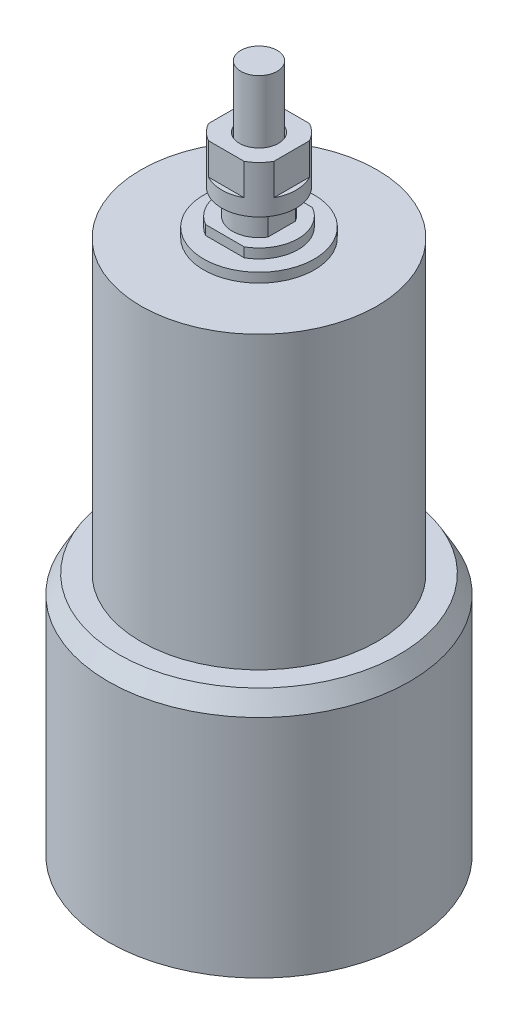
ISO-10303-21;
HEADER;
FILE_DESCRIPTION(('STEP AP214'),'2;1');
FILE_NAME('part.step','',(''),(''),'','','');
FILE_SCHEMA(('AUTOMOTIVE_DESIGN { 1 0 10303 214 1 1 1 1 }'));
ENDSEC;
DATA;
#1=APPLICATION_CONTEXT('core data for automotive mechanical design processes');
#2=APPLICATION_PROTOCOL_DEFINITION('international standard','automotive_design',2000,#1);
#3=PRODUCT_CONTEXT('',#1,'mechanical');
#4=PRODUCT('Part','Part','',(#3));
#5=PRODUCT_RELATED_PRODUCT_CATEGORY('part','',(#4));
#6=PRODUCT_DEFINITION_FORMATION('','',#4);
#7=PRODUCT_DEFINITION_CONTEXT('part definition',#1,'design');
#8=PRODUCT_DEFINITION('design','',#6,#7);
#9=PRODUCT_DEFINITION_SHAPE('','',#8);
#10=(LENGTH_UNIT() NAMED_UNIT(*) SI_UNIT(.MILLI.,.METRE.));
#11=(NAMED_UNIT(*) PLANE_ANGLE_UNIT() SI_UNIT($,.RADIAN.));
#12=(NAMED_UNIT(*) SI_UNIT($,.STERADIAN.) SOLID_ANGLE_UNIT());
#13=UNCERTAINTY_MEASURE_WITH_UNIT(LENGTH_MEASURE(1.E-05),#10,'distance_accuracy_value','');
#14=(GEOMETRIC_REPRESENTATION_CONTEXT(3) GLOBAL_UNCERTAINTY_ASSIGNED_CONTEXT((#13)) GLOBAL_UNIT_ASSIGNED_CONTEXT((#10,
#11,#12)) REPRESENTATION_CONTEXT('',''));
#15=CARTESIAN_POINT('',(0.,0.,0.));
#16=DIRECTION('',(0.,0.,1.));
#17=DIRECTION('',(1.,0.,0.));
#18=AXIS2_PLACEMENT_3D('',#15,#16,#17);
#19=CARTESIAN_POINT('',(0.,117.1194,0.));
#20=DIRECTION('',(0.,1.,0.));
#21=DIRECTION('',(0.,0.,1.));
#22=AXIS2_PLACEMENT_3D('',#19,#20,#21);
#23=PLANE('',#22);
#24=CARTESIAN_POINT('',(0.,117.1194,0.));
#25=DIRECTION('',(0.,1.,0.));
#26=DIRECTION('',(0.,0.,1.));
#27=AXIS2_PLACEMENT_3D('',#24,#25,#26);
#28=CIRCLE('',#27,6.8199);
#29=CARTESIAN_POINT('',(0.,117.1194,6.8199));
#30=VERTEX_POINT('',#29);
#31=EDGE_CURVE('E250',#30,#30,#28,.F.);
#32=ORIENTED_EDGE('',*,*,#31,.F.);
#33=EDGE_LOOP('',(#32));
#34=FACE_BOUND('',#33,.T.);
#35=CARTESIAN_POINT('',(0.,117.1194,0.));
#36=DIRECTION('',(0.,1.,0.));
#37=DIRECTION('',(0.,0.,1.));
#38=AXIS2_PLACEMENT_3D('',#35,#36,#37);
#39=CIRCLE('',#38,6.35);
#40=CARTESIAN_POINT('',(0.,117.1194,-6.35));
#41=VERTEX_POINT('',#40);
#42=EDGE_CURVE('E375',#41,#41,#39,.T.);
#43=ORIENTED_EDGE('',*,*,#42,.F.);
#44=EDGE_LOOP('',(#43));
#45=FACE_BOUND('',#44,.T.);
#46=ADVANCED_FACE('F32',(#34,#45),#23,.T.);
#47=CARTESIAN_POINT('',(0.,133.6294,0.));
#48=DIRECTION('',(0.,1.,0.));
#49=DIRECTION('',(0.,0.,1.));
#50=AXIS2_PLACEMENT_3D('',#47,#48,#49);
#51=PLANE('',#50);
#52=CARTESIAN_POINT('',(0.,133.6294,0.));
#53=DIRECTION('',(0.,1.,0.));
#54=DIRECTION('',(0.,0.,1.));
#55=AXIS2_PLACEMENT_3D('',#52,#53,#54);
#56=CIRCLE('',#55,6.8199);
#57=CARTESIAN_POINT('',(0.,133.6294,6.8199));
#58=VERTEX_POINT('',#57);
#59=EDGE_CURVE('E389',#58,#58,#56,.T.);
#60=ORIENTED_EDGE('',*,*,#59,.F.);
#61=EDGE_LOOP('',(#60));
#62=FACE_BOUND('',#61,.T.);
#63=CARTESIAN_POINT('',(0.,133.6294,0.));
#64=DIRECTION('',(0.,1.,0.));
#65=DIRECTION('',(0.,0.,1.));
#66=AXIS2_PLACEMENT_3D('',#63,#64,#65);
#67=CIRCLE('',#66,13.0175);
#68=CARTESIAN_POINT('',(6.22979985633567,133.6294,11.43));
#69=VERTEX_POINT('',#68);
#70=CARTESIAN_POINT('',(11.43,133.6294,6.22979985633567));
#71=VERTEX_POINT('',#70);
#72=EDGE_CURVE('E172',#69,#71,#67,.T.);
#73=ORIENTED_EDGE('',*,*,#72,.T.);
#74=DIRECTION('',(0.,0.,-1.));
#75=VECTOR('',#74,1.);
#76=CARTESIAN_POINT('',(11.43,133.6294,-11.43));
#77=LINE('',#76,#75);
#78=CARTESIAN_POINT('',(11.43,133.6294,-6.22979985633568));
#79=VERTEX_POINT('',#78);
#80=EDGE_CURVE('E156',#71,#79,#77,.T.);
#81=ORIENTED_EDGE('',*,*,#80,.T.);
#82=CARTESIAN_POINT('',(6.22979985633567,133.6294,-11.43));
#83=VERTEX_POINT('',#82);
#84=EDGE_CURVE('E164',#79,#83,#67,.T.);
#85=ORIENTED_EDGE('',*,*,#84,.T.);
#86=DIRECTION('',(-1.,0.,0.));
#87=VECTOR('',#86,1.);
#88=CARTESIAN_POINT('',(11.43,133.6294,-11.43));
#89=LINE('',#88,#87);
#90=CARTESIAN_POINT('',(-6.22979985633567,133.6294,-11.43));
#91=VERTEX_POINT('',#90);
#92=EDGE_CURVE('E144',#83,#91,#89,.T.);
#93=ORIENTED_EDGE('',*,*,#92,.T.);
#94=CARTESIAN_POINT('',(-11.43,133.6294,-6.22979985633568));
#95=VERTEX_POINT('',#94);
#96=EDGE_CURVE('E173',#91,#95,#67,.T.);
#97=ORIENTED_EDGE('',*,*,#96,.T.);
#98=DIRECTION('',(0.,0.,1.));
#99=VECTOR('',#98,1.);
#100=CARTESIAN_POINT('',(-11.43,133.6294,-11.43));
#101=LINE('',#100,#99);
#102=CARTESIAN_POINT('',(-11.43,133.6294,6.22979985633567));
#103=VERTEX_POINT('',#102);
#104=EDGE_CURVE('E155',#95,#103,#101,.T.);
#105=ORIENTED_EDGE('',*,*,#104,.T.);
#106=CARTESIAN_POINT('',(-6.22979985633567,133.6294,11.43));
#107=VERTEX_POINT('',#106);
#108=EDGE_CURVE('E176',#103,#107,#67,.T.);
#109=ORIENTED_EDGE('',*,*,#108,.T.);
#110=DIRECTION('',(1.,0.,0.));
#111=VECTOR('',#110,1.);
#112=CARTESIAN_POINT('',(11.43,133.6294,11.43));
#113=LINE('',#112,#111);
#114=EDGE_CURVE('E381',#107,#69,#113,.T.);
#115=ORIENTED_EDGE('',*,*,#114,.T.);
#116=EDGE_LOOP('',(#73,#81,#85,#93,#97,#105,#109,#115));
#117=FACE_BOUND('',#116,.T.);
#118=ADVANCED_FACE('F171',(#62,#117),#51,.T.);
#119=CARTESIAN_POINT('',(0.,133.6294,0.));
#120=DIRECTION('',(0.,-1.,0.));
#121=DIRECTION('',(0.,0.,-1.));
#122=AXIS2_PLACEMENT_3D('',#119,#120,#121);
#123=CYLINDRICAL_SURFACE('',#122,13.0175);
#124=CARTESIAN_POINT('',(0.,117.1194,0.));
#125=DIRECTION('',(0.,1.,0.));
#126=DIRECTION('',(0.,0.,1.));
#127=AXIS2_PLACEMENT_3D('',#124,#125,#126);
#128=CIRCLE('',#127,13.0175);
#129=CARTESIAN_POINT('',(0.,117.1194,13.0175));
#130=VERTEX_POINT('',#129);
#131=EDGE_CURVE('E179',#130,#130,#128,.T.);
#132=ORIENTED_EDGE('',*,*,#131,.T.);
#133=EDGE_LOOP('',(#132));
#134=FACE_BOUND('',#133,.T.);
#135=DIRECTION('',(0.,-1.,0.));
#136=VECTOR('',#135,1.);
#137=CARTESIAN_POINT('',(11.43,133.6294,6.22979985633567));
#138=LINE('',#137,#136);
#139=CARTESIAN_POINT('',(11.43,122.6058,6.22979985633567));
#140=VERTEX_POINT('',#139);
#141=EDGE_CURVE('E267',#71,#140,#138,.T.);
#142=ORIENTED_EDGE('',*,*,#141,.F.);
#143=ORIENTED_EDGE('',*,*,#72,.F.);
#144=DIRECTION('',(0.,-1.,0.));
#145=VECTOR('',#144,1.);
#146=CARTESIAN_POINT('',(6.22979985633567,133.6294,11.43));
#147=LINE('',#146,#145);
#148=CARTESIAN_POINT('',(6.22979985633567,122.6058,11.43));
#149=VERTEX_POINT('',#148);
#150=EDGE_CURVE('E260',#149,#69,#147,.F.);
#151=ORIENTED_EDGE('',*,*,#150,.F.);
#152=CARTESIAN_POINT('',(0.,122.6058,0.));
#153=DIRECTION('',(0.,1.,0.));
#154=DIRECTION('',(0.,0.,1.));
#155=AXIS2_PLACEMENT_3D('',#152,#153,#154);
#156=CIRCLE('',#155,13.0175);
#157=CARTESIAN_POINT('',(-6.22979985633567,122.6058,11.43));
#158=VERTEX_POINT('',#157);
#159=EDGE_CURVE('E262',#158,#149,#156,.T.);
#160=ORIENTED_EDGE('',*,*,#159,.F.);
#161=DIRECTION('',(0.,-1.,0.));
#162=VECTOR('',#161,1.);
#163=CARTESIAN_POINT('',(-6.22979985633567,133.6294,11.43));
#164=LINE('',#163,#162);
#165=EDGE_CURVE('E263',#107,#158,#164,.T.);
#166=ORIENTED_EDGE('',*,*,#165,.F.);
#167=ORIENTED_EDGE('',*,*,#108,.F.);
#168=DIRECTION('',(0.,-1.,0.));
#169=VECTOR('',#168,1.);
#170=CARTESIAN_POINT('',(-11.43,133.6294,6.22979985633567));
#171=LINE('',#170,#169);
#172=CARTESIAN_POINT('',(-11.43,122.6058,6.22979985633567));
#173=VERTEX_POINT('',#172);
#174=EDGE_CURVE('E167',#173,#103,#171,.F.);
#175=ORIENTED_EDGE('',*,*,#174,.F.);
#176=CARTESIAN_POINT('',(-11.43,122.6058,-6.22979985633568));
#177=VERTEX_POINT('',#176);
#178=EDGE_CURVE('E255',#177,#173,#156,.T.);
#179=ORIENTED_EDGE('',*,*,#178,.F.);
#180=DIRECTION('',(0.,-1.,0.));
#181=VECTOR('',#180,1.);
#182=CARTESIAN_POINT('',(-11.43,133.6294,-6.22979985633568));
#183=LINE('',#182,#181);
#184=EDGE_CURVE('E258',#95,#177,#183,.T.);
#185=ORIENTED_EDGE('',*,*,#184,.F.);
#186=ORIENTED_EDGE('',*,*,#96,.F.);
#187=DIRECTION('',(0.,-1.,0.));
#188=VECTOR('',#187,1.);
#189=CARTESIAN_POINT('',(-6.22979985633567,133.6294,-11.43));
#190=LINE('',#189,#188);
#191=CARTESIAN_POINT('',(-6.22979985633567,122.6058,-11.43));
#192=VERTEX_POINT('',#191);
#193=EDGE_CURVE('E150',#192,#91,#190,.F.);
#194=ORIENTED_EDGE('',*,*,#193,.F.);
#195=CARTESIAN_POINT('',(6.22979985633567,122.6058,-11.43));
#196=VERTEX_POINT('',#195);
#197=EDGE_CURVE('E166',#196,#192,#156,.T.);
#198=ORIENTED_EDGE('',*,*,#197,.F.);
#199=DIRECTION('',(0.,-1.,0.));
#200=VECTOR('',#199,1.);
#201=CARTESIAN_POINT('',(6.22979985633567,133.6294,-11.43));
#202=LINE('',#201,#200);
#203=EDGE_CURVE('E147',#83,#196,#202,.T.);
#204=ORIENTED_EDGE('',*,*,#203,.F.);
#205=ORIENTED_EDGE('',*,*,#84,.F.);
#206=DIRECTION('',(0.,-1.,0.));
#207=VECTOR('',#206,1.);
#208=CARTESIAN_POINT('',(11.43,133.6294,-6.22979985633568));
#209=LINE('',#208,#207);
#210=CARTESIAN_POINT('',(11.43,122.6058,-6.22979985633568));
#211=VERTEX_POINT('',#210);
#212=EDGE_CURVE('E265',#211,#79,#209,.F.);
#213=ORIENTED_EDGE('',*,*,#212,.F.);
#214=EDGE_CURVE('E254',#140,#211,#156,.T.);
#215=ORIENTED_EDGE('',*,*,#214,.F.);
#216=EDGE_LOOP('',(#142,#143,#151,#160,#166,#167,#175,#179,#185,#186,#194,#198,#204,#205,#213,#215));
#217=FACE_BOUND('',#216,.T.);
#218=ADVANCED_FACE('F162',(#134,#217),#123,.T.);
#219=CARTESIAN_POINT('',(0.,108.2294,0.));
#220=DIRECTION('',(0.,1.,0.));
#221=DIRECTION('',(0.,0.,1.));
#222=AXIS2_PLACEMENT_3D('',#219,#220,#221);
#223=PLANE('',#222);
#224=CARTESIAN_POINT('',(0.,108.2294,0.));
#225=DIRECTION('',(0.,1.,0.));
#226=DIRECTION('',(0.,0.,1.));
#227=AXIS2_PLACEMENT_3D('',#224,#225,#226);
#228=CIRCLE('',#227,13.6906);
#229=CARTESIAN_POINT('',(6.74703561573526,108.2294,11.9126));
#230=VERTEX_POINT('',#229);
#231=CARTESIAN_POINT('',(6.74703561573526,108.2294,-11.9126));
#232=VERTEX_POINT('',#231);
#233=EDGE_CURVE('E222',#230,#232,#228,.T.);
#234=ORIENTED_EDGE('',*,*,#233,.T.);
#235=DIRECTION('',(-1.,0.,0.));
#236=VECTOR('',#235,1.);
#237=CARTESIAN_POINT('',(6.74703561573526,108.2294,-11.9126));
#238=LINE('',#237,#236);
#239=CARTESIAN_POINT('',(-6.74703561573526,108.2294,-11.9126));
#240=VERTEX_POINT('',#239);
#241=EDGE_CURVE('E225',#232,#240,#238,.T.);
#242=ORIENTED_EDGE('',*,*,#241,.T.);
#243=CARTESIAN_POINT('',(0.,108.2294,0.));
#244=DIRECTION('',(0.,1.,0.));
#245=DIRECTION('',(0.,0.,1.));
#246=AXIS2_PLACEMENT_3D('',#243,#244,#245);
#247=CIRCLE('',#246,13.6906);
#248=CARTESIAN_POINT('',(-6.74703561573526,108.2294,11.9126));
#249=VERTEX_POINT('',#248);
#250=EDGE_CURVE('E227',#240,#249,#247,.T.);
#251=ORIENTED_EDGE('',*,*,#250,.T.);
#252=DIRECTION('',(1.,0.,0.));
#253=VECTOR('',#252,1.);
#254=CARTESIAN_POINT('',(6.74703561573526,108.2294,11.9126));
#255=LINE('',#254,#253);
#256=EDGE_CURVE('E229',#249,#230,#255,.T.);
#257=ORIENTED_EDGE('',*,*,#256,.T.);
#258=EDGE_LOOP('',(#234,#242,#251,#257));
#259=FACE_BOUND('',#258,.T.);
#260=DIRECTION('',(0.,0.,1.));
#261=VECTOR('',#260,1.);
#262=CARTESIAN_POINT('',(-7.9375,108.2294,-4.79035851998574));
#263=LINE('',#262,#261);
#264=CARTESIAN_POINT('',(-7.9375,108.2294,-4.79035851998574));
#265=VERTEX_POINT('',#264);
#266=CARTESIAN_POINT('',(-7.9375,108.2294,4.79035851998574));
#267=VERTEX_POINT('',#266);
#268=EDGE_CURVE('E183',#265,#267,#263,.T.);
#269=ORIENTED_EDGE('',*,*,#268,.F.);
#270=CARTESIAN_POINT('',(0.,108.2294,0.));
#271=DIRECTION('',(0.,1.,0.));
#272=DIRECTION('',(0.,0.,1.));
#273=AXIS2_PLACEMENT_3D('',#270,#271,#272);
#274=CIRCLE('',#273,9.271);
#275=CARTESIAN_POINT('',(7.9375,108.2294,-4.79035851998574));
#276=VERTEX_POINT('',#275);
#277=EDGE_CURVE('E175',#276,#265,#274,.T.);
#278=ORIENTED_EDGE('',*,*,#277,.F.);
#279=DIRECTION('',(0.,0.,-1.));
#280=VECTOR('',#279,1.);
#281=CARTESIAN_POINT('',(7.9375,108.2294,-4.79035851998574));
#282=LINE('',#281,#280);
#283=CARTESIAN_POINT('',(7.9375,108.2294,4.79035851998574));
#284=VERTEX_POINT('',#283);
#285=EDGE_CURVE('E188',#284,#276,#282,.T.);
#286=ORIENTED_EDGE('',*,*,#285,.F.);
#287=CARTESIAN_POINT('',(0.,108.2294,0.));
#288=DIRECTION('',(0.,1.,0.));
#289=DIRECTION('',(0.,0.,1.));
#290=AXIS2_PLACEMENT_3D('',#287,#288,#289);
#291=CIRCLE('',#290,9.271);
#292=EDGE_CURVE('E185',#267,#284,#291,.T.);
#293=ORIENTED_EDGE('',*,*,#292,.F.);
#294=EDGE_LOOP('',(#269,#278,#286,#293));
#295=FACE_BOUND('',#294,.T.);
#296=ADVANCED_FACE('F329',(#259,#295),#223,.T.);
#297=CARTESIAN_POINT('',(0.,104.902,0.));
#298=DIRECTION('',(0.,1.,0.));
#299=DIRECTION('',(0.,0.,1.));
#300=AXIS2_PLACEMENT_3D('',#297,#298,#299);
#301=PLANE('',#300);
#302=CARTESIAN_POINT('',(0.,104.902,0.));
#303=DIRECTION('',(0.,1.,0.));
#304=DIRECTION('',(0.,0.,1.));
#305=AXIS2_PLACEMENT_3D('',#302,#303,#304);
#306=CIRCLE('',#305,19.3675);
#307=CARTESIAN_POINT('',(0.,104.902,-19.3675));
#308=VERTEX_POINT('',#307);
#309=EDGE_CURVE('E244',#308,#308,#306,.T.);
#310=ORIENTED_EDGE('',*,*,#309,.T.);
#311=EDGE_LOOP('',(#310));
#312=FACE_BOUND('',#311,.T.);
#313=DIRECTION('',(-1.,0.,0.));
#314=VECTOR('',#313,1.);
#315=CARTESIAN_POINT('',(6.74703561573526,104.902,-11.9126));
#316=LINE('',#315,#314);
#317=CARTESIAN_POINT('',(6.74703561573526,104.902,-11.9126));
#318=VERTEX_POINT('',#317);
#319=CARTESIAN_POINT('',(-6.74703561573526,104.902,-11.9126));
#320=VERTEX_POINT('',#319);
#321=EDGE_CURVE('E215',#318,#320,#316,.T.);
#322=ORIENTED_EDGE('',*,*,#321,.F.);
#323=CARTESIAN_POINT('',(0.,104.902,0.));
#324=DIRECTION('',(0.,1.,0.));
#325=DIRECTION('',(0.,0.,1.));
#326=AXIS2_PLACEMENT_3D('',#323,#324,#325);
#327=CIRCLE('',#326,13.6906);
#328=CARTESIAN_POINT('',(6.74703561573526,104.902,11.9126));
#329=VERTEX_POINT('',#328);
#330=EDGE_CURVE('E212',#329,#318,#327,.T.);
#331=ORIENTED_EDGE('',*,*,#330,.F.);
#332=DIRECTION('',(1.,0.,0.));
#333=VECTOR('',#332,1.);
#334=CARTESIAN_POINT('',(6.74703561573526,104.902,11.9126));
#335=LINE('',#334,#333);
#336=CARTESIAN_POINT('',(-6.74703561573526,104.902,11.9126));
#337=VERTEX_POINT('',#336);
#338=EDGE_CURVE('E220',#337,#329,#335,.T.);
#339=ORIENTED_EDGE('',*,*,#338,.F.);
#340=CARTESIAN_POINT('',(0.,104.902,0.));
#341=DIRECTION('',(0.,1.,0.));
#342=DIRECTION('',(0.,0.,1.));
#343=AXIS2_PLACEMENT_3D('',#340,#341,#342);
#344=CIRCLE('',#343,13.6906);
#345=EDGE_CURVE('E217',#320,#337,#344,.T.);
#346=ORIENTED_EDGE('',*,*,#345,.F.);
#347=EDGE_LOOP('',(#322,#331,#339,#346));
#348=FACE_BOUND('',#347,.T.);
#349=ADVANCED_FACE('F332',(#312,#348),#301,.T.);
#350=CARTESIAN_POINT('',(0.,101.6,0.));
#351=DIRECTION('',(0.,1.,0.));
#352=DIRECTION('',(0.,0.,1.));
#353=AXIS2_PLACEMENT_3D('',#350,#351,#352);
#354=PLANE('',#353);
#355=CARTESIAN_POINT('',(0.,101.6,0.));
#356=DIRECTION('',(0.,1.,0.));
#357=DIRECTION('',(0.,0.,1.));
#358=AXIS2_PLACEMENT_3D('',#355,#356,#357);
#359=CIRCLE('',#358,41.275);
#360=CARTESIAN_POINT('',(0.,101.6,41.275));
#361=VERTEX_POINT('',#360);
#362=EDGE_CURVE('E247',#361,#361,#359,.T.);
#363=ORIENTED_EDGE('',*,*,#362,.T.);
#364=EDGE_LOOP('',(#363));
#365=FACE_BOUND('',#364,.T.);
#366=CARTESIAN_POINT('',(0.,101.6,0.));
#367=DIRECTION('',(0.,1.,0.));
#368=DIRECTION('',(0.,0.,1.));
#369=AXIS2_PLACEMENT_3D('',#366,#367,#368);
#370=CIRCLE('',#369,19.3675);
#371=CARTESIAN_POINT('',(0.,101.6,-19.3675));
#372=VERTEX_POINT('',#371);
#373=EDGE_CURVE('E241',#372,#372,#370,.T.);
#374=ORIENTED_EDGE('',*,*,#373,.F.);
#375=EDGE_LOOP('',(#374));
#376=FACE_BOUND('',#375,.T.);
#377=ADVANCED_FACE('F352',(#365,#376),#354,.T.);
#378=CARTESIAN_POINT('',(0.,101.6,0.));
#379=DIRECTION('',(0.,-1.,0.));
#380=DIRECTION('',(0.,0.,-1.));
#381=AXIS2_PLACEMENT_3D('',#378,#379,#380);
#382=CYLINDRICAL_SURFACE('',#381,41.275);
#383=ORIENTED_EDGE('',*,*,#362,.F.);
#384=EDGE_LOOP('',(#383));
#385=FACE_BOUND('',#384,.T.);
#386=CARTESIAN_POINT('',(0.,0.,0.));
#387=DIRECTION('',(0.,-1.,0.));
#388=DIRECTION('',(0.,0.,-1.));
#389=AXIS2_PLACEMENT_3D('',#386,#387,#388);
#390=CIRCLE('',#389,41.275);
#391=CARTESIAN_POINT('',(0.,0.,-41.275));
#392=VERTEX_POINT('',#391);
#393=EDGE_CURVE('E369',#392,#392,#390,.T.);
#394=ORIENTED_EDGE('',*,*,#393,.F.);
#395=EDGE_LOOP('',(#394));
#396=FACE_BOUND('',#395,.T.);
#397=ADVANCED_FACE('F356',(#385,#396),#382,.T.);
#398=CARTESIAN_POINT('',(0.,104.902,0.));
#399=DIRECTION('',(0.,-1.,0.));
#400=DIRECTION('',(0.,0.,-1.));
#401=AXIS2_PLACEMENT_3D('',#398,#399,#400);
#402=CYLINDRICAL_SURFACE('',#401,19.3675);
#403=CARTESIAN_POINT('',(0.,104.902,-19.3675));
#404=CARTESIAN_POINT('',(0.,104.867604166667,-19.3675));
#405=CARTESIAN_POINT('',(0.,104.833208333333,-19.3675));
#406=CARTESIAN_POINT('',(0.,104.764416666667,-19.3675));
#407=CARTESIAN_POINT('',(0.,104.730020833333,-19.3675));
#408=CARTESIAN_POINT('',(0.,104.661229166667,-19.3675));
#409=CARTESIAN_POINT('',(0.,104.626833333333,-19.3675));
#410=CARTESIAN_POINT('',(0.,104.558041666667,-19.3675));
#411=CARTESIAN_POINT('',(0.,104.523645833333,-19.3675));
#412=CARTESIAN_POINT('',(0.,104.454854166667,-19.3675));
#413=CARTESIAN_POINT('',(0.,104.420458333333,-19.3675));
#414=CARTESIAN_POINT('',(0.,104.351666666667,-19.3675));
#415=CARTESIAN_POINT('',(0.,104.317270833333,-19.3675));
#416=CARTESIAN_POINT('',(0.,104.248479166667,-19.3675));
#417=CARTESIAN_POINT('',(0.,104.214083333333,-19.3675));
#418=CARTESIAN_POINT('',(0.,104.145291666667,-19.3675));
#419=CARTESIAN_POINT('',(0.,104.110895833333,-19.3675));
#420=CARTESIAN_POINT('',(0.,104.042104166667,-19.3675));
#421=CARTESIAN_POINT('',(0.,104.007708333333,-19.3675));
#422=CARTESIAN_POINT('',(0.,103.938916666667,-19.3675));
#423=CARTESIAN_POINT('',(0.,103.904520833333,-19.3675));
#424=CARTESIAN_POINT('',(0.,103.835729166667,-19.3675));
#425=CARTESIAN_POINT('',(0.,103.801333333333,-19.3675));
#426=CARTESIAN_POINT('',(0.,103.732541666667,-19.3675));
#427=CARTESIAN_POINT('',(0.,103.698145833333,-19.3675));
#428=CARTESIAN_POINT('',(0.,103.629354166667,-19.3675));
#429=CARTESIAN_POINT('',(0.,103.594958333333,-19.3675));
#430=CARTESIAN_POINT('',(0.,103.526166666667,-19.3675));
#431=CARTESIAN_POINT('',(0.,103.491770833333,-19.3675));
#432=CARTESIAN_POINT('',(0.,103.422979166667,-19.3675));
#433=CARTESIAN_POINT('',(0.,103.388583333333,-19.3675));
#434=CARTESIAN_POINT('',(0.,103.319791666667,-19.3675));
#435=CARTESIAN_POINT('',(0.,103.285395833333,-19.3675));
#436=CARTESIAN_POINT('',(0.,103.216604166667,-19.3675));
#437=CARTESIAN_POINT('',(0.,103.182208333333,-19.3675));
#438=CARTESIAN_POINT('',(0.,103.113416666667,-19.3675));
#439=CARTESIAN_POINT('',(0.,103.079020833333,-19.3675));
#440=CARTESIAN_POINT('',(0.,103.010229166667,-19.3675));
#441=CARTESIAN_POINT('',(0.,102.975833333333,-19.3675));
#442=CARTESIAN_POINT('',(0.,102.907041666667,-19.3675));
#443=CARTESIAN_POINT('',(0.,102.872645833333,-19.3675));
#444=CARTESIAN_POINT('',(0.,102.803854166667,-19.3675));
#445=CARTESIAN_POINT('',(0.,102.769458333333,-19.3675));
#446=CARTESIAN_POINT('',(0.,102.700666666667,-19.3675));
#447=CARTESIAN_POINT('',(0.,102.666270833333,-19.3675));
#448=CARTESIAN_POINT('',(0.,102.597479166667,-19.3675));
#449=CARTESIAN_POINT('',(0.,102.563083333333,-19.3675));
#450=CARTESIAN_POINT('',(0.,102.494291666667,-19.3675));
#451=CARTESIAN_POINT('',(0.,102.459895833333,-19.3675));
#452=CARTESIAN_POINT('',(0.,102.391104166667,-19.3675));
#453=CARTESIAN_POINT('',(0.,102.356708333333,-19.3675));
#454=CARTESIAN_POINT('',(0.,102.287916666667,-19.3675));
#455=CARTESIAN_POINT('',(0.,102.253520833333,-19.3675));
#456=CARTESIAN_POINT('',(0.,102.184729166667,-19.3675));
#457=CARTESIAN_POINT('',(0.,102.150333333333,-19.3675));
#458=CARTESIAN_POINT('',(0.,102.081541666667,-19.3675));
#459=CARTESIAN_POINT('',(0.,102.047145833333,-19.3675));
#460=CARTESIAN_POINT('',(0.,101.978354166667,-19.3675));
#461=CARTESIAN_POINT('',(0.,101.943958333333,-19.3675));
#462=CARTESIAN_POINT('',(0.,101.875166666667,-19.3675));
#463=CARTESIAN_POINT('',(0.,101.840770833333,-19.3675));
#464=CARTESIAN_POINT('',(0.,101.771979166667,-19.3675));
#465=CARTESIAN_POINT('',(0.,101.737583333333,-19.3675));
#466=CARTESIAN_POINT('',(0.,101.668791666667,-19.3675));
#467=CARTESIAN_POINT('',(0.,101.634395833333,-19.3675));
#468=CARTESIAN_POINT('',(0.,101.6,-19.3675));
#469=B_SPLINE_CURVE_WITH_KNOTS('',3,(#403,#404,#405,#406,#407,#408,#409,#410,#411,#412,#413,
#414,#415,#416,#417,#418,#419,#420,#421,#422,#423,#424,#425,#426,#427,#428,#429,#430,#431,#432,
#433,#434,#435,#436,#437,#438,#439,#440,#441,#442,#443,#444,#445,#446,#447,#448,#449,#450,#451,
#452,#453,#454,#455,#456,#457,#458,#459,#460,#461,#462,#463,#464,#465,#466,#467,#468),
.UNSPECIFIED.,.F.,.F.,(4,2,2,2,2,2,2,2,2,2,2,2,2,2,2,2,2,2,2,2,2,2,2,2,2,2,2,2,2,2,2,2,4),(0.,
0.103187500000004,0.206375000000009,0.309562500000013,0.412750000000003,0.515937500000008,
0.619125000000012,0.722312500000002,0.825500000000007,0.928687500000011,1.031875,
1.13506250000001,1.23825000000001,1.3414375,1.444625,1.54781250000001,1.65100000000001,
1.7541875,1.85737500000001,1.96056250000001,2.06375,2.16693750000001,2.27012500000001,2.3733125,
2.47650000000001,2.57968750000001,2.682875,2.78606250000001,2.88925000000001,2.9924375,3.095625,
3.19881250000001,3.30200000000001),.UNSPECIFIED.);
#470=EDGE_CURVE('BSEAM348',#308,#372,#469,.T.);
#471=ORIENTED_EDGE('',*,*,#309,.F.);
#472=ORIENTED_EDGE('',*,*,#373,.T.);
#473=ORIENTED_EDGE('',*,*,#470,.T.);
#474=ORIENTED_EDGE('',*,*,#470,.F.);
#475=EDGE_LOOP('',(#471,#473,#472,#474));
#476=FACE_BOUND('',#475,.T.);
#477=ADVANCED_FACE('F348',(#476),#402,.T.);
#478=CARTESIAN_POINT('',(0.,108.2294,0.));
#479=DIRECTION('',(0.,-1.,0.));
#480=DIRECTION('',(0.,0.,-1.));
#481=AXIS2_PLACEMENT_3D('',#478,#479,#480);
#482=CYLINDRICAL_SURFACE('',#481,13.6906);
#483=ORIENTED_EDGE('',*,*,#330,.T.);
#484=DIRECTION('',(0.,-1.,0.));
#485=VECTOR('',#484,1.);
#486=CARTESIAN_POINT('',(6.74703561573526,108.2294,-11.9126));
#487=LINE('',#486,#485);
#488=EDGE_CURVE('E239',#232,#318,#487,.T.);
#489=ORIENTED_EDGE('',*,*,#488,.F.);
#490=ORIENTED_EDGE('',*,*,#233,.F.);
#491=DIRECTION('',(0.,-1.,0.));
#492=VECTOR('',#491,1.);
#493=CARTESIAN_POINT('',(6.74703561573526,108.2294,11.9126));
#494=LINE('',#493,#492);
#495=EDGE_CURVE('E231',#230,#329,#494,.T.);
#496=ORIENTED_EDGE('',*,*,#495,.T.);
#497=EDGE_LOOP('',(#483,#489,#490,#496));
#498=FACE_BOUND('',#497,.T.);
#499=ADVANCED_FACE('F344',(#498),#482,.T.);
#500=CARTESIAN_POINT('',(6.74703561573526,108.2294,-11.9126));
#501=DIRECTION('',(0.,0.,1.));
#502=DIRECTION('',(1.,0.,0.));
#503=AXIS2_PLACEMENT_3D('',#500,#501,#502);
#504=PLANE('',#503);
#505=ORIENTED_EDGE('',*,*,#321,.T.);
#506=DIRECTION('',(0.,-1.,0.));
#507=VECTOR('',#506,1.);
#508=CARTESIAN_POINT('',(-6.74703561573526,108.2294,-11.9126));
#509=LINE('',#508,#507);
#510=EDGE_CURVE('E236',#240,#320,#509,.T.);
#511=ORIENTED_EDGE('',*,*,#510,.F.);
#512=ORIENTED_EDGE('',*,*,#241,.F.);
#513=ORIENTED_EDGE('',*,*,#488,.T.);
#514=EDGE_LOOP('',(#505,#511,#512,#513));
#515=FACE_BOUND('',#514,.T.);
#516=ADVANCED_FACE('F340',(#515),#504,.F.);
#517=CARTESIAN_POINT('',(0.,108.2294,0.));
#518=DIRECTION('',(0.,-1.,0.));
#519=DIRECTION('',(0.,0.,-1.));
#520=AXIS2_PLACEMENT_3D('',#517,#518,#519);
#521=CYLINDRICAL_SURFACE('',#520,13.6906);
#522=ORIENTED_EDGE('',*,*,#345,.T.);
#523=DIRECTION('',(0.,-1.,0.));
#524=VECTOR('',#523,1.);
#525=CARTESIAN_POINT('',(-6.74703561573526,108.2294,11.9126));
#526=LINE('',#525,#524);
#527=EDGE_CURVE('E234',#249,#337,#526,.T.);
#528=ORIENTED_EDGE('',*,*,#527,.F.);
#529=ORIENTED_EDGE('',*,*,#250,.F.);
#530=ORIENTED_EDGE('',*,*,#510,.T.);
#531=EDGE_LOOP('',(#522,#528,#529,#530));
#532=FACE_BOUND('',#531,.T.);
#533=ADVANCED_FACE('F336',(#532),#521,.T.);
#534=CARTESIAN_POINT('',(6.74703561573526,108.2294,11.9126));
#535=DIRECTION('',(0.,0.,-1.));
#536=DIRECTION('',(-1.,0.,0.));
#537=AXIS2_PLACEMENT_3D('',#534,#535,#536);
#538=PLANE('',#537);
#539=ORIENTED_EDGE('',*,*,#338,.T.);
#540=ORIENTED_EDGE('',*,*,#495,.F.);
#541=ORIENTED_EDGE('',*,*,#256,.F.);
#542=ORIENTED_EDGE('',*,*,#527,.T.);
#543=EDGE_LOOP('',(#539,#540,#541,#542));
#544=FACE_BOUND('',#543,.T.);
#545=ADVANCED_FACE('F327',(#544),#538,.F.);
#546=CARTESIAN_POINT('',(0.,117.1194,0.));
#547=DIRECTION('',(0.,-1.,0.));
#548=DIRECTION('',(0.,0.,-1.));
#549=AXIS2_PLACEMENT_3D('',#546,#547,#548);
#550=CYLINDRICAL_SURFACE('',#549,9.271);
#551=ORIENTED_EDGE('',*,*,#277,.T.);
#552=DIRECTION('',(0.,-1.,0.));
#553=VECTOR('',#552,1.);
#554=CARTESIAN_POINT('',(-7.9375,117.1194,-4.79035851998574));
#555=LINE('',#554,#553);
#556=CARTESIAN_POINT('',(-7.9375,117.1194,-4.79035851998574));
#557=VERTEX_POINT('',#556);
#558=EDGE_CURVE('E210',#557,#265,#555,.T.);
#559=ORIENTED_EDGE('',*,*,#558,.F.);
#560=CARTESIAN_POINT('',(0.,117.1194,0.));
#561=DIRECTION('',(0.,1.,0.));
#562=DIRECTION('',(0.,0.,1.));
#563=AXIS2_PLACEMENT_3D('',#560,#561,#562);
#564=CIRCLE('',#563,9.271);
#565=CARTESIAN_POINT('',(7.9375,117.1194,-4.79035851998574));
#566=VERTEX_POINT('',#565);
#567=EDGE_CURVE('E190',#566,#557,#564,.T.);
#568=ORIENTED_EDGE('',*,*,#567,.F.);
#569=DIRECTION('',(0.,-1.,0.));
#570=VECTOR('',#569,1.);
#571=CARTESIAN_POINT('',(7.9375,117.1194,-4.79035851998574));
#572=LINE('',#571,#570);
#573=EDGE_CURVE('E202',#566,#276,#572,.T.);
#574=ORIENTED_EDGE('',*,*,#573,.T.);
#575=EDGE_LOOP('',(#551,#559,#568,#574));
#576=FACE_BOUND('',#575,.T.);
#577=ADVANCED_FACE('F323',(#576),#550,.T.);
#578=CARTESIAN_POINT('',(-7.9375,117.1194,-4.79035851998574));
#579=DIRECTION('',(1.,0.,0.));
#580=DIRECTION('',(0.,0.,-1.));
#581=AXIS2_PLACEMENT_3D('',#578,#579,#580);
#582=PLANE('',#581);
#583=ORIENTED_EDGE('',*,*,#268,.T.);
#584=DIRECTION('',(0.,-1.,0.));
#585=VECTOR('',#584,1.);
#586=CARTESIAN_POINT('',(-7.9375,117.1194,4.79035851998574));
#587=LINE('',#586,#585);
#588=CARTESIAN_POINT('',(-7.9375,117.1194,4.79035851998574));
#589=VERTEX_POINT('',#588);
#590=EDGE_CURVE('E207',#589,#267,#587,.T.);
#591=ORIENTED_EDGE('',*,*,#590,.F.);
#592=DIRECTION('',(0.,0.,1.));
#593=VECTOR('',#592,1.);
#594=CARTESIAN_POINT('',(-7.9375,117.1194,-4.79035851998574));
#595=LINE('',#594,#593);
#596=EDGE_CURVE('E193',#557,#589,#595,.T.);
#597=ORIENTED_EDGE('',*,*,#596,.F.);
#598=ORIENTED_EDGE('',*,*,#558,.T.);
#599=EDGE_LOOP('',(#583,#591,#597,#598));
#600=FACE_BOUND('',#599,.T.);
#601=ADVANCED_FACE('F319',(#600),#582,.F.);
#602=CARTESIAN_POINT('',(0.,117.1194,0.));
#603=DIRECTION('',(0.,-1.,0.));
#604=DIRECTION('',(0.,0.,-1.));
#605=AXIS2_PLACEMENT_3D('',#602,#603,#604);
#606=CYLINDRICAL_SURFACE('',#605,9.271);
#607=ORIENTED_EDGE('',*,*,#292,.T.);
#608=DIRECTION('',(0.,-1.,0.));
#609=VECTOR('',#608,1.);
#610=CARTESIAN_POINT('',(7.9375,117.1194,4.79035851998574));
#611=LINE('',#610,#609);
#612=CARTESIAN_POINT('',(7.9375,117.1194,4.79035851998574));
#613=VERTEX_POINT('',#612);
#614=EDGE_CURVE('E205',#613,#284,#611,.T.);
#615=ORIENTED_EDGE('',*,*,#614,.F.);
#616=CARTESIAN_POINT('',(0.,117.1194,0.));
#617=DIRECTION('',(0.,1.,0.));
#618=DIRECTION('',(0.,0.,1.));
#619=AXIS2_PLACEMENT_3D('',#616,#617,#618);
#620=CIRCLE('',#619,9.271);
#621=EDGE_CURVE('E196',#589,#613,#620,.T.);
#622=ORIENTED_EDGE('',*,*,#621,.F.);
#623=ORIENTED_EDGE('',*,*,#590,.T.);
#624=EDGE_LOOP('',(#607,#615,#622,#623));
#625=FACE_BOUND('',#624,.T.);
#626=ADVANCED_FACE('F315',(#625),#606,.T.);
#627=CARTESIAN_POINT('',(7.9375,117.1194,-4.79035851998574));
#628=DIRECTION('',(-1.,0.,0.));
#629=DIRECTION('',(0.,0.,1.));
#630=AXIS2_PLACEMENT_3D('',#627,#628,#629);
#631=PLANE('',#630);
#632=ORIENTED_EDGE('',*,*,#285,.T.);
#633=ORIENTED_EDGE('',*,*,#573,.F.);
#634=DIRECTION('',(0.,0.,-1.));
#635=VECTOR('',#634,1.);
#636=CARTESIAN_POINT('',(7.9375,117.1194,-4.79035851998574));
#637=LINE('',#636,#635);
#638=EDGE_CURVE('E199',#613,#566,#637,.T.);
#639=ORIENTED_EDGE('',*,*,#638,.F.);
#640=ORIENTED_EDGE('',*,*,#614,.T.);
#641=EDGE_LOOP('',(#632,#633,#639,#640));
#642=FACE_BOUND('',#641,.T.);
#643=ADVANCED_FACE('F311',(#642),#631,.F.);
#644=CARTESIAN_POINT('',(0.,117.1194,0.));
#645=DIRECTION('',(0.,1.,0.));
#646=DIRECTION('',(0.,0.,1.));
#647=AXIS2_PLACEMENT_3D('',#644,#645,#646);
#648=PLANE('',#647);
#649=ORIENTED_EDGE('',*,*,#131,.F.);
#650=EDGE_LOOP('',(#649));
#651=FACE_BOUND('',#650,.T.);
#652=ORIENTED_EDGE('',*,*,#638,.T.);
#653=ORIENTED_EDGE('',*,*,#567,.T.);
#654=ORIENTED_EDGE('',*,*,#596,.T.);
#655=ORIENTED_EDGE('',*,*,#621,.T.);
#656=EDGE_LOOP('',(#652,#653,#654,#655));
#657=FACE_BOUND('',#656,.T.);
#658=ADVANCED_FACE('F314',(#651,#657),#648,.F.);
#659=CARTESIAN_POINT('',(0.,133.6294,0.));
#660=DIRECTION('',(0.,-1.,0.));
#661=DIRECTION('',(0.,0.,-1.));
#662=AXIS2_PLACEMENT_3D('',#659,#660,#661);
#663=CYLINDRICAL_SURFACE('',#662,6.8199);
#664=ORIENTED_EDGE('',*,*,#59,.T.);
#665=EDGE_LOOP('',(#664));
#666=FACE_BOUND('',#665,.T.);
#667=ORIENTED_EDGE('',*,*,#31,.T.);
#668=EDGE_LOOP('',(#667));
#669=FACE_BOUND('',#668,.T.);
#670=ADVANCED_FACE('F430',(#666,#669),#663,.F.);
#671=CARTESIAN_POINT('',(11.43,122.6058,-11.43));
#672=DIRECTION('',(0.,0.,-1.));
#673=DIRECTION('',(-1.,0.,0.));
#674=AXIS2_PLACEMENT_3D('',#671,#672,#673);
#675=PLANE('',#674);
#676=ORIENTED_EDGE('',*,*,#203,.T.);
#677=DIRECTION('',(-1.,0.,0.));
#678=VECTOR('',#677,1.);
#679=CARTESIAN_POINT('',(11.43,122.6058,-11.43));
#680=LINE('',#679,#678);
#681=EDGE_CURVE('E385',#196,#192,#680,.T.);
#682=ORIENTED_EDGE('',*,*,#681,.T.);
#683=ORIENTED_EDGE('',*,*,#193,.T.);
#684=ORIENTED_EDGE('',*,*,#92,.F.);
#685=EDGE_LOOP('',(#676,#682,#683,#684));
#686=FACE_BOUND('',#685,.T.);
#687=ADVANCED_FACE('F146',(#686),#675,.T.);
#688=CARTESIAN_POINT('',(0.,122.6058,0.));
#689=DIRECTION('',(0.,1.,0.));
#690=DIRECTION('',(0.,0.,1.));
#691=AXIS2_PLACEMENT_3D('',#688,#689,#690);
#692=PLANE('',#691);
#693=ORIENTED_EDGE('',*,*,#197,.T.);
#694=ORIENTED_EDGE('',*,*,#681,.F.);
#695=EDGE_LOOP('',(#693,#694));
#696=FACE_BOUND('',#695,.T.);
#697=ADVANCED_FACE('F413',(#696),#692,.T.);
#698=CARTESIAN_POINT('',(-11.43,122.6058,-11.43));
#699=DIRECTION('',(-1.,0.,0.));
#700=DIRECTION('',(0.,0.,1.));
#701=AXIS2_PLACEMENT_3D('',#698,#699,#700);
#702=PLANE('',#701);
#703=ORIENTED_EDGE('',*,*,#184,.T.);
#704=DIRECTION('',(0.,0.,1.));
#705=VECTOR('',#704,1.);
#706=CARTESIAN_POINT('',(-11.43,122.6058,-11.43));
#707=LINE('',#706,#705);
#708=EDGE_CURVE('E387',#177,#173,#707,.T.);
#709=ORIENTED_EDGE('',*,*,#708,.T.);
#710=ORIENTED_EDGE('',*,*,#174,.T.);
#711=ORIENTED_EDGE('',*,*,#104,.F.);
#712=EDGE_LOOP('',(#703,#709,#710,#711));
#713=FACE_BOUND('',#712,.T.);
#714=ADVANCED_FACE('F422',(#713),#702,.T.);
#715=ORIENTED_EDGE('',*,*,#178,.T.);
#716=ORIENTED_EDGE('',*,*,#708,.F.);
#717=EDGE_LOOP('',(#715,#716));
#718=FACE_BOUND('',#717,.T.);
#719=ADVANCED_FACE('F419',(#718),#692,.T.);
#720=CARTESIAN_POINT('',(11.43,122.6058,11.43));
#721=DIRECTION('',(0.,0.,1.));
#722=DIRECTION('',(1.,0.,0.));
#723=AXIS2_PLACEMENT_3D('',#720,#721,#722);
#724=PLANE('',#723);
#725=ORIENTED_EDGE('',*,*,#165,.T.);
#726=DIRECTION('',(1.,0.,0.));
#727=VECTOR('',#726,1.);
#728=CARTESIAN_POINT('',(11.43,122.6058,11.43));
#729=LINE('',#728,#727);
#730=EDGE_CURVE('E55',#158,#149,#729,.T.);
#731=ORIENTED_EDGE('',*,*,#730,.T.);
#732=ORIENTED_EDGE('',*,*,#150,.T.);
#733=ORIENTED_EDGE('',*,*,#114,.F.);
#734=EDGE_LOOP('',(#725,#731,#732,#733));
#735=FACE_BOUND('',#734,.T.);
#736=ADVANCED_FACE('F404',(#735),#724,.T.);
#737=ORIENTED_EDGE('',*,*,#159,.T.);
#738=ORIENTED_EDGE('',*,*,#730,.F.);
#739=EDGE_LOOP('',(#737,#738));
#740=FACE_BOUND('',#739,.T.);
#741=ADVANCED_FACE('F406',(#740),#692,.T.);
#742=ORIENTED_EDGE('',*,*,#214,.T.);
#743=DIRECTION('',(0.,0.,-1.));
#744=VECTOR('',#743,1.);
#745=CARTESIAN_POINT('',(11.43,122.6058,-11.43));
#746=LINE('',#745,#744);
#747=EDGE_CURVE('E47',#140,#211,#746,.T.);
#748=ORIENTED_EDGE('',*,*,#747,.F.);
#749=EDGE_LOOP('',(#742,#748));
#750=FACE_BOUND('',#749,.T.);
#751=ADVANCED_FACE('F410',(#750),#692,.T.);
#752=CARTESIAN_POINT('',(11.43,122.6058,-11.43));
#753=DIRECTION('',(1.,0.,0.));
#754=DIRECTION('',(0.,0.,-1.));
#755=AXIS2_PLACEMENT_3D('',#752,#753,#754);
#756=PLANE('',#755);
#757=ORIENTED_EDGE('',*,*,#141,.T.);
#758=ORIENTED_EDGE('',*,*,#747,.T.);
#759=ORIENTED_EDGE('',*,*,#212,.T.);
#760=ORIENTED_EDGE('',*,*,#80,.F.);
#761=EDGE_LOOP('',(#757,#758,#759,#760));
#762=FACE_BOUND('',#761,.T.);
#763=ADVANCED_FACE('F408',(#762),#756,.T.);
#764=CARTESIAN_POINT('',(0.,0.,0.));
#765=DIRECTION('',(0.,-1.,0.));
#766=DIRECTION('',(0.,0.,-1.));
#767=AXIS2_PLACEMENT_3D('',#764,#765,#766);
#768=PLANE('',#767);
#769=CARTESIAN_POINT('',(0.,0.,0.));
#770=DIRECTION('',(0.,-1.,0.));
#771=DIRECTION('',(0.,0.,-1.));
#772=AXIS2_PLACEMENT_3D('',#769,#770,#771);
#773=CIRCLE('',#772,49.0388257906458);
#774=CARTESIAN_POINT('',(0.,0.,-49.0388257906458));
#775=VERTEX_POINT('',#774);
#776=EDGE_CURVE('E11',#775,#775,#773,.F.);
#777=ORIENTED_EDGE('',*,*,#776,.T.);
#778=EDGE_LOOP('',(#777));
#779=FACE_BOUND('',#778,.T.);
#780=ORIENTED_EDGE('',*,*,#393,.T.);
#781=EDGE_LOOP('',(#780));
#782=FACE_BOUND('',#781,.T.);
#783=ADVANCED_FACE('F296',(#779,#782),#768,.F.);
#784=CARTESIAN_POINT('',(0.,-88.9,0.));
#785=DIRECTION('',(0.,1.,0.));
#786=DIRECTION('',(0.,0.,1.));
#787=AXIS2_PLACEMENT_3D('',#784,#785,#786);
#788=CYLINDRICAL_SURFACE('',#787,52.705);
#789=CARTESIAN_POINT('',(0.,-85.2338257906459,0.));
#790=DIRECTION('',(0.,-1.,0.));
#791=DIRECTION('',(0.,0.,-1.));
#792=AXIS2_PLACEMENT_3D('',#789,#790,#791);
#793=CIRCLE('',#792,52.705);
#794=CARTESIAN_POINT('',(0.,-85.2338257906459,-52.705));
#795=VERTEX_POINT('',#794);
#796=EDGE_CURVE('E40',#795,#795,#793,.F.);
#797=ORIENTED_EDGE('',*,*,#796,.T.);
#798=EDGE_LOOP('',(#797));
#799=FACE_BOUND('',#798,.T.);
#800=CARTESIAN_POINT('',(0.,-6.35000000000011,0.));
#801=DIRECTION('',(0.,-1.,0.));
#802=DIRECTION('',(0.,0.,-1.));
#803=AXIS2_PLACEMENT_3D('',#800,#801,#802);
#804=CIRCLE('',#803,52.705);
#805=CARTESIAN_POINT('',(0.,-6.35000000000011,-52.705));
#806=VERTEX_POINT('',#805);
#807=EDGE_CURVE('E272',#806,#806,#804,.T.);
#808=ORIENTED_EDGE('',*,*,#807,.T.);
#809=EDGE_LOOP('',(#808));
#810=FACE_BOUND('',#809,.T.);
#811=ADVANCED_FACE('F277',(#799,#810),#788,.T.);
#812=CARTESIAN_POINT('',(0.,-88.9,0.));
#813=DIRECTION('',(0.,-1.,0.));
#814=DIRECTION('',(0.,0.,-1.));
#815=AXIS2_PLACEMENT_3D('',#812,#813,#814);
#816=PLANE('',#815);
#817=CARTESIAN_POINT('',(0.,-88.9,0.));
#818=DIRECTION('',(0.,-1.,0.));
#819=DIRECTION('',(0.,0.,-1.));
#820=AXIS2_PLACEMENT_3D('',#817,#818,#819);
#821=CIRCLE('',#820,46.355);
#822=CARTESIAN_POINT('',(0.,-88.9,-46.355));
#823=VERTEX_POINT('',#822);
#824=EDGE_CURVE('E269',#823,#823,#821,.T.);
#825=ORIENTED_EDGE('',*,*,#824,.T.);
#826=EDGE_LOOP('',(#825));
#827=FACE_BOUND('',#826,.T.);
#828=ADVANCED_FACE('F286',(#827),#816,.T.);
#829=CARTESIAN_POINT('',(0.,155.2194,0.));
#830=DIRECTION('',(0.,-1.,0.));
#831=DIRECTION('',(0.,0.,-1.));
#832=AXIS2_PLACEMENT_3D('',#829,#830,#831);
#833=CYLINDRICAL_SURFACE('',#832,6.35);
#834=CARTESIAN_POINT('',(0.,155.2194,0.));
#835=DIRECTION('',(0.,1.,0.));
#836=DIRECTION('',(0.,0.,1.));
#837=AXIS2_PLACEMENT_3D('',#834,#835,#836);
#838=CIRCLE('',#837,6.35);
#839=CARTESIAN_POINT('',(0.,155.2194,-6.35));
#840=VERTEX_POINT('',#839);
#841=EDGE_CURVE('E371',#840,#840,#838,.T.);
#842=CARTESIAN_POINT('',(0.,155.2194,-6.35));
#843=CARTESIAN_POINT('',(0.,154.822525,-6.35));
#844=CARTESIAN_POINT('',(0.,154.42565,-6.35));
#845=CARTESIAN_POINT('',(0.,153.6319,-6.35));
#846=CARTESIAN_POINT('',(0.,153.235025,-6.35));
#847=CARTESIAN_POINT('',(0.,152.441275,-6.35));
#848=CARTESIAN_POINT('',(0.,152.0444,-6.35));
#849=CARTESIAN_POINT('',(0.,151.25065,-6.35));
#850=CARTESIAN_POINT('',(0.,150.853775,-6.35));
#851=CARTESIAN_POINT('',(0.,150.060025,-6.35));
#852=CARTESIAN_POINT('',(0.,149.66315,-6.35));
#853=CARTESIAN_POINT('',(0.,148.8694,-6.35));
#854=CARTESIAN_POINT('',(0.,148.472525,-6.35));
#855=CARTESIAN_POINT('',(0.,147.678775,-6.35));
#856=CARTESIAN_POINT('',(0.,147.2819,-6.35));
#857=CARTESIAN_POINT('',(0.,146.48815,-6.35));
#858=CARTESIAN_POINT('',(0.,146.091275,-6.35));
#859=CARTESIAN_POINT('',(0.,145.297525,-6.35));
#860=CARTESIAN_POINT('',(0.,144.90065,-6.35));
#861=CARTESIAN_POINT('',(0.,144.1069,-6.35));
#862=CARTESIAN_POINT('',(0.,143.710025,-6.35));
#863=CARTESIAN_POINT('',(0.,142.916275,-6.35));
#864=CARTESIAN_POINT('',(0.,142.5194,-6.35));
#865=CARTESIAN_POINT('',(0.,141.72565,-6.35));
#866=CARTESIAN_POINT('',(0.,141.328775,-6.35));
#867=CARTESIAN_POINT('',(0.,140.535025,-6.35));
#868=CARTESIAN_POINT('',(0.,140.13815,-6.35));
#869=CARTESIAN_POINT('',(0.,139.3444,-6.35));
#870=CARTESIAN_POINT('',(0.,138.947525,-6.35));
#871=CARTESIAN_POINT('',(0.,138.153775,-6.35));
#872=CARTESIAN_POINT('',(0.,137.7569,-6.35));
#873=CARTESIAN_POINT('',(0.,136.96315,-6.35));
#874=CARTESIAN_POINT('',(0.,136.566275,-6.35));
#875=CARTESIAN_POINT('',(0.,135.772525,-6.35));
#876=CARTESIAN_POINT('',(0.,135.37565,-6.35));
#877=CARTESIAN_POINT('',(0.,134.5819,-6.35));
#878=CARTESIAN_POINT('',(0.,134.185025,-6.35));
#879=CARTESIAN_POINT('',(0.,133.391275,-6.35));
#880=CARTESIAN_POINT('',(0.,132.9944,-6.35));
#881=CARTESIAN_POINT('',(0.,132.20065,-6.35));
#882=CARTESIAN_POINT('',(0.,131.803775,-6.35));
#883=CARTESIAN_POINT('',(0.,131.010025,-6.35));
#884=CARTESIAN_POINT('',(0.,130.61315,-6.35));
#885=CARTESIAN_POINT('',(0.,129.8194,-6.35));
#886=CARTESIAN_POINT('',(0.,129.422525,-6.35));
#887=CARTESIAN_POINT('',(0.,128.628775,-6.35));
#888=CARTESIAN_POINT('',(0.,128.2319,-6.35));
#889=CARTESIAN_POINT('',(0.,127.43815,-6.35));
#890=CARTESIAN_POINT('',(0.,127.041275,-6.35));
#891=CARTESIAN_POINT('',(0.,126.247525,-6.35));
#892=CARTESIAN_POINT('',(0.,125.85065,-6.35));
#893=CARTESIAN_POINT('',(0.,125.0569,-6.35));
#894=CARTESIAN_POINT('',(0.,124.660025,-6.35));
#895=CARTESIAN_POINT('',(0.,123.866275,-6.35));
#896=CARTESIAN_POINT('',(0.,123.4694,-6.35));
#897=CARTESIAN_POINT('',(0.,122.67565,-6.35));
#898=CARTESIAN_POINT('',(0.,122.278775,-6.35));
#899=CARTESIAN_POINT('',(0.,121.485025,-6.35));
#900=CARTESIAN_POINT('',(0.,121.08815,-6.35));
#901=CARTESIAN_POINT('',(0.,120.2944,-6.35));
#902=CARTESIAN_POINT('',(0.,119.897525,-6.35));
#903=CARTESIAN_POINT('',(0.,119.103775,-6.35));
#904=CARTESIAN_POINT('',(0.,118.7069,-6.35));
#905=CARTESIAN_POINT('',(0.,117.91315,-6.35));
#906=CARTESIAN_POINT('',(0.,117.516275,-6.35));
#907=CARTESIAN_POINT('',(0.,117.1194,-6.35));
#908=B_SPLINE_CURVE_WITH_KNOTS('',3,(#842,#843,#844,#845,#846,#847,#848,#849,#850,#851,#852,
#853,#854,#855,#856,#857,#858,#859,#860,#861,#862,#863,#864,#865,#866,#867,#868,#869,#870,#871,
#872,#873,#874,#875,#876,#877,#878,#879,#880,#881,#882,#883,#884,#885,#886,#887,#888,#889,#890,
#891,#892,#893,#894,#895,#896,#897,#898,#899,#900,#901,#902,#903,#904,#905,#906,#907),
.UNSPECIFIED.,.F.,.F.,(4,2,2,2,2,2,2,2,2,2,2,2,2,2,2,2,2,2,2,2,2,2,2,2,2,2,2,2,2,2,2,2,4),(0.,
1.190625,2.38125,3.571875,4.7625,5.953125,7.14375,8.334375,9.52500000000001,10.715625,11.90625,
13.096875,14.2875,15.478125,16.66875,17.859375,19.05,20.240625,21.43125,22.621875,23.8125,
25.003125,26.19375,27.384375,28.575,29.765625,30.95625,32.146875,33.3375,34.528125,35.71875,
36.909375,38.1),.UNSPECIFIED.);
#909=EDGE_CURVE('BSEAM288',#840,#41,#908,.T.);
#910=ORIENTED_EDGE('',*,*,#841,.F.);
#911=ORIENTED_EDGE('',*,*,#42,.T.);
#912=ORIENTED_EDGE('',*,*,#909,.T.);
#913=ORIENTED_EDGE('',*,*,#909,.F.);
#914=EDGE_LOOP('',(#910,#912,#911,#913));
#915=FACE_BOUND('',#914,.T.);
#916=ADVANCED_FACE('F288',(#915),#833,.T.);
#917=CARTESIAN_POINT('',(0.,155.2194,0.));
#918=DIRECTION('',(0.,1.,0.));
#919=DIRECTION('',(0.,0.,1.));
#920=AXIS2_PLACEMENT_3D('',#917,#918,#919);
#921=PLANE('',#920);
#922=ORIENTED_EDGE('',*,*,#841,.T.);
#923=EDGE_LOOP('',(#922));
#924=FACE_BOUND('',#923,.T.);
#925=ADVANCED_FACE('F283',(#924),#921,.T.);
#926=CARTESIAN_POINT('',(0.,-88.9,0.));
#927=DIRECTION('',(0.,1.,0.));
#928=DIRECTION('',(0.,0.,1.));
#929=AXIS2_PLACEMENT_3D('',#926,#927,#928);
#930=CONICAL_SURFACE('',#929,46.355,1.0471975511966);
#931=ORIENTED_EDGE('',*,*,#796,.F.);
#932=EDGE_LOOP('',(#931));
#933=FACE_BOUND('',#932,.T.);
#934=ORIENTED_EDGE('',*,*,#824,.F.);
#935=EDGE_LOOP('',(#934));
#936=FACE_BOUND('',#935,.T.);
#937=ADVANCED_FACE('F280',(#933,#936),#930,.T.);
#938=CARTESIAN_POINT('',(0.,-6.35000000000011,0.));
#939=DIRECTION('',(0.,-1.,0.));
#940=DIRECTION('',(0.,0.,-1.));
#941=AXIS2_PLACEMENT_3D('',#938,#939,#940);
#942=CONICAL_SURFACE('',#941,52.705,0.5235987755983);
#943=ORIENTED_EDGE('',*,*,#776,.F.);
#944=EDGE_LOOP('',(#943));
#945=FACE_BOUND('',#944,.T.);
#946=ORIENTED_EDGE('',*,*,#807,.F.);
#947=EDGE_LOOP('',(#946));
#948=FACE_BOUND('',#947,.T.);
#949=ADVANCED_FACE('F34',(#945,#948),#942,.T.);
#950=CLOSED_SHELL('',(#46,#118,#218,#296,#349,#377,#397,#477,#499,#516,#533,#545,#577,#601,#626,
#643,#658,#670,#687,#697,#714,#719,#736,#741,#751,#763,#783,#811,#828,#916,#925,#937,#949));
#951=MANIFOLD_SOLID_BREP('B2',#950);
#952=ADVANCED_BREP_SHAPE_REPRESENTATION('',(#18,#951),#14);
#953=SHAPE_DEFINITION_REPRESENTATION(#9,#952);
ENDSEC;
END-ISO-10303-21;
